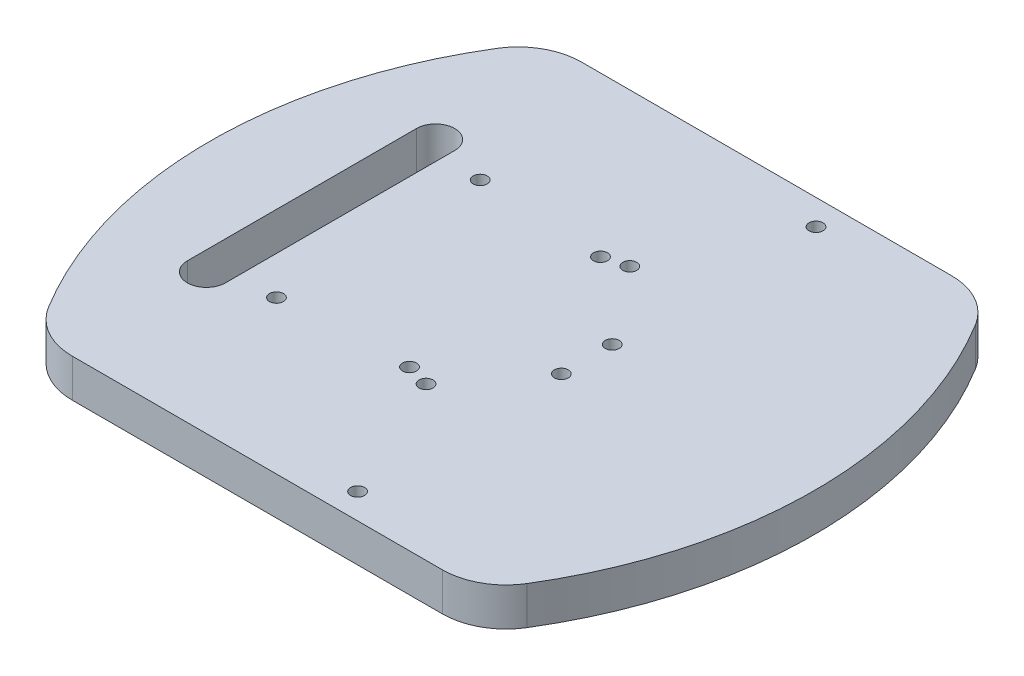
from build123d import *

# Parameters (mm, degrees)
ESQUISSE1_R      = 1.1
EXTRUSION1_DEPTH = 6


with BuildPart() as part:
    # Esquisse1 → Extrusion1 (new body)
    with BuildSketch(Plane(origin=(0, 0, 0), x_dir=(1, 0, 0), z_dir=(0, 1, 0))):
        with BuildLine():
            Line((-34.053542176, 40), (24.053542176, 40))
            ThreePointArc((24.053542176, 40), (28.943638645, 38.72278376), (32.584592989, 35.217391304))
            ThreePointArc((32.584592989, 35.217391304), (42.5, 0), (32.584592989, -35.217391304))
            ThreePointArc((32.584592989, -35.217391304), (28.943638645, -38.72278376), (24.053542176, -40))
            Line((24.053542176, -40), (-34.053542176, -40))
            ThreePointArc((-34.053542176, -40), (-38.943638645, -38.72278376), (-42.584592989, -35.217391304))
            ThreePointArc((-42.584592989, -35.217391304), (-52.5, 0), (-42.584592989, 35.217391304))
            ThreePointArc((-42.584592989, 35.217391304), (-38.943638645, 38.72278376), (-34.053542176, 40))
        make_face()
        with Locations(Location((-2.5, 16, 0), (0, 0, 270))):
            Circle(ESQUISSE1_R, mode=Mode.SUBTRACT)
        with Locations(Location((-26, 16, 0), (0, 0, 270))):
            Circle(ESQUISSE1_R, mode=Mode.SUBTRACT)
        with Locations(Location((-2.5, -16, 0), (0, 0, 90))):
            Circle(ESQUISSE1_R, mode=Mode.SUBTRACT)
        with Locations(Location((-26, -16, 0), (0, 0, 90))):
            Circle(ESQUISSE1_R, mode=Mode.SUBTRACT)
        with Locations(Location((-6.1, 15, 0), (0, 0, 270))):
            Circle(ESQUISSE1_R, mode=Mode.SUBTRACT)
        with Locations(Location((6.75, 36, 0), (0, 0, 270))):
            Circle(ESQUISSE1_R, mode=Mode.SUBTRACT)
        with Locations(Location((6.75, 4, 0), (0, 0, 90))):
            Circle(ESQUISSE1_R, mode=Mode.SUBTRACT)
        with Locations(Location((6.75, -36, 0), (0, 0, 90))):
            Circle(ESQUISSE1_R, mode=Mode.SUBTRACT)
        with Locations(Location((6.75, -4, 0), (0, 0, 270))):
            Circle(ESQUISSE1_R, mode=Mode.SUBTRACT)
        with Locations(Location((-6.1, -15, 0), (0, 0, 90))):
            Circle(ESQUISSE1_R, mode=Mode.SUBTRACT)
        with BuildLine():
            Line((-38, 18), (-38, -18))
            ThreePointArc((-38, -18), (-35, -21), (-32, -18))
            Line((-32, -18), (-32, 18))
            ThreePointArc((-32, 18), (-35, 21), (-38, 18))
        make_face(mode=Mode.SUBTRACT)
    extrude(amount=EXTRUSION1_DEPTH)


solid = part.part
